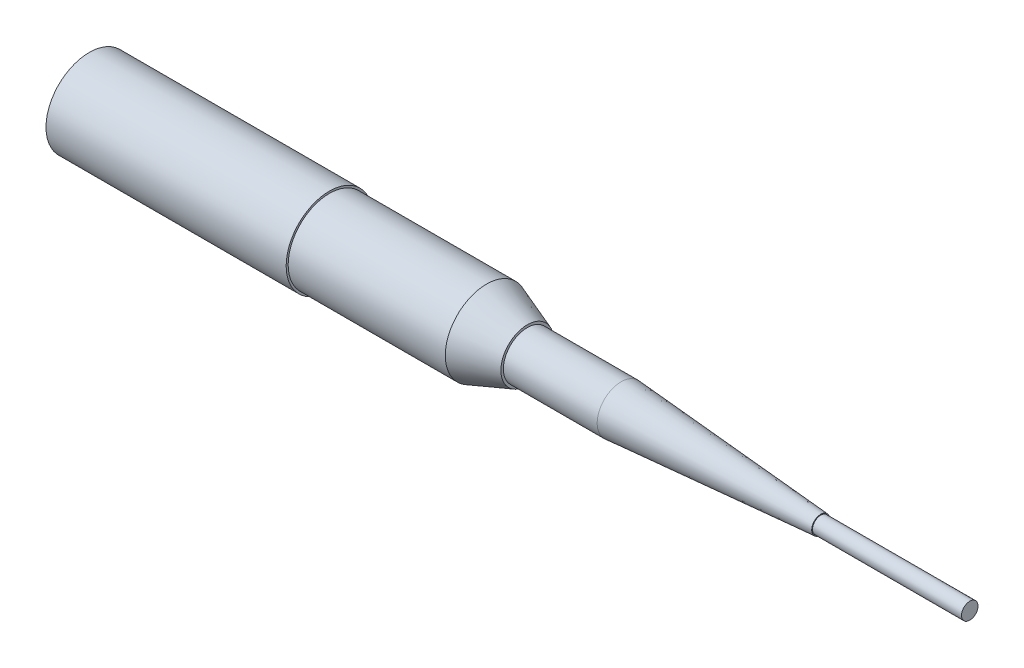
from build123d import *

# Parameters (mm, degrees)
SKETCH4_R          = 22.2504
CUT_EXTRUDE1_DEPTH = 25.4


with BuildPart() as part:
    # Sketch1 → Revolve1 (revolve)
    with BuildSketch(Plane.XY, mode=Mode.PRIVATE) as revolve1_sk:
        Polygon((465.766227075, 0), (465.766227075, 25.4), (6.691539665, 25.4), (6.691539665, 27.94), (-608.547260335, 73.66), (-897.548460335, 73.66), (-897.548460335, 81.28), (-1023.163127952, 127), (-1507.160127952, 127), (-1507.160127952, 133.1722), (-2247.062127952, 133.1722), (-2247.062127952, 120.65), (-2132.901727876, 120.65), (-2132.901727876, 0), align=None)
    revolve(revolve1_sk.sketch.rotate(Axis((-2373.708626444, 0, 0), (1, 0, 0)), 90), axis=Axis((-2373.708626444, 0, 0), (1, 0, 0)))

    # Sketch4 → Cut-Extrude1 (cut)
    with BuildSketch(Plane.ZY.offset(2132.901727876)):
        with Locations((0, 43.9928)):
            Circle(SKETCH4_R)
        with Locations(Location((0, -43.9928, 0), (0, 0, 180))):
            Circle(SKETCH4_R)
    extrude(amount=-CUT_EXTRUDE1_DEPTH, mode=Mode.SUBTRACT)


solid = part.part
